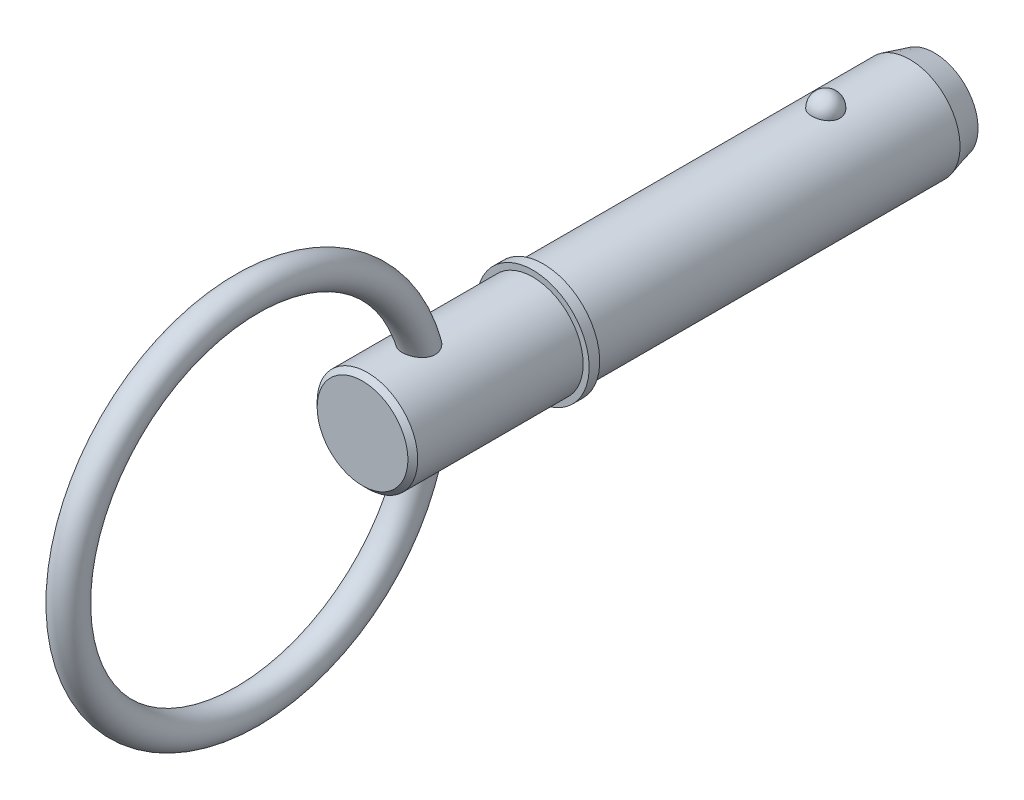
from build123d import *

# Parameters (mm, degrees)
SKETCH2_R           = 7.145
BOSS_EXTRUDE1_DEPTH = 38.1
BOSS_EXTRUDE2_START = 17.45
SKETCH3_R           = 7.145
BOSS_EXTRUDE2_DEPTH = 17.45
CHAMFER1_SIZE       = 3.5
CHAMFER1_SIZE2      = 0.937822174
SKETCH20_W          = 1.5
SKETCH20_H          = 8
SKETCH21_R          = 7.145
BOSS_EXTRUDE3_DEPTH = 25.7
CHAMFER2_SIZE       = 0.7
SKETCH24_R          = 2.25


with BuildPart() as part:
    # Sketch2 → Boss-Extrude1 (new body)
    with BuildSketch(Plane.XY):
        with Locations(Location((0, 0, 0), (0, 0, 180))):
            Circle(SKETCH2_R)
    extrude(amount=BOSS_EXTRUDE1_DEPTH)

    # Sketch3 → Boss-Extrude2 (add)
    with BuildSketch(Plane(origin=(0, 0, 0), x_dir=(-1, 0, 0), z_dir=(0, 0, -1)).offset(BOSS_EXTRUDE2_START)):
        Circle(SKETCH3_R)
    extrude(amount=-BOSS_EXTRUDE2_DEPTH)

    # Chamfer1
    chamfer1_edges = [part.edges().sort_by_distance(p)[0] for p in [
        (7.145, 0, -17.45),
    ]]
    chamfer1_side = [part.faces().sort_by_distance(p)[0] for p in [
        (7.145, 0, 10.325),
    ]]
    chamfer(chamfer1_edges, length=CHAMFER1_SIZE, length2=CHAMFER1_SIZE2, reference=chamfer1_side[0])

    # Sketch18 → Revolve1 (revolve)
    with BuildSketch(Plane(origin=(0, 0, 0), x_dir=(0, 0, -1), z_dir=(1, 0, 0))):
        with BuildLine():
            Line((2.02, 9.165), (2.02, 5.125))
            ThreePointArc((2.02, 5.125), (0, 7.145), (2.02, 9.165))
        make_face()
    revolve(axis=Axis((0, 9.165, -2.02), (0, -1, 0)))

    # Sketch20 → Revolve2 (revolve)
    with BuildSketch(Plane(origin=(0, 0, 0), x_dir=(0, 0, -1), z_dir=(1, 0, 0)), mode=Mode.PRIVATE) as revolve2_sk:
        with Locations((-38.85, 4)):
            Rectangle(SKETCH20_W, SKETCH20_H)
    revolve(revolve2_sk.sketch.rotate(Axis((0, 0, 33.728787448), (0, 0, 1)), 90), axis=Axis((0, 0, 33.728787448), (0, 0, 1)))

    # Sketch21 → Boss-Extrude3 (add)
    with BuildSketch(Plane(origin=(0, 0, 38.1), x_dir=(-1, 0, 0), z_dir=(0, 0, -1))):
        Circle(SKETCH21_R)
    extrude(amount=-BOSS_EXTRUDE3_DEPTH)

    # Chamfer2
    chamfer2_edges = [part.edges().sort_by_distance(p)[0] for p in [
        (7.145, 0, 63.8),
    ]]
    chamfer(chamfer2_edges, length=CHAMFER2_SIZE)

    # Sweep1: sweep along a path in Sketch23
    with BuildLine(Plane(origin=(0, 0, 0), x_dir=(0, 0, -1), z_dir=(1, 0, 0))) as sweep1_path:
        CenterArc((-80.2, 0), 25.4, 0, 360)
    # Sketch24 → Sweep1 (sweep)
    with BuildSketch(Plane(origin=(0, 0, 0), x_dir=(1, 0, 0), z_dir=(0, 1, 0))):
        with Locations((0, -54.8)):
            Circle(SKETCH24_R)
    sweep(path=sweep1_path.line)


solid = part.part
